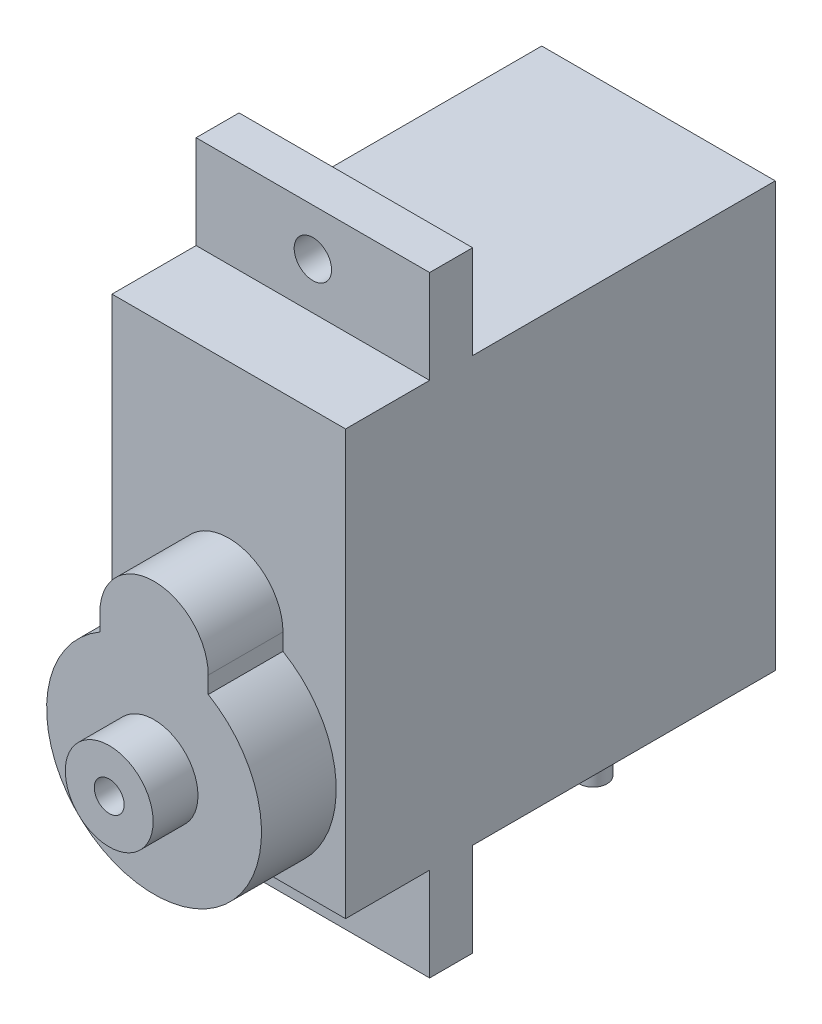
from build123d import *

# Parameters (mm, degrees)
CROQUIS1_W              = 12.5
CROQUIS1_H              = 22.7
SALIENTE_EXTRUIR1_DEPTH = 23
SALIENTE_EXTRUIR2_DEPTH = 4
CROQUIS3_W              = 2.3
CROQUIS3_H              = 5
SALIENTE_EXTRUIR3_DEPTH = 6.25
CORTAR_EXTRUIR1_REACH   = 27.468
CROQUIS4_R              = 1
SALIENTE_EXTRUIR4_START = -4
CROQUIS5_W              = 4
CROQUIS5_H              = 5
SALIENTE_EXTRUIR4_DEPTH = 1.5
CROQUIS6_R              = 2.35
CROQUIS6_R_2            = 0.8
SALIENTE_EXTRUIR5_DEPTH = 2.4
SKETCH1_W               = 4.514706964
SKETCH1_H               = 2.103718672
CUT_EXTRUDE2_DEPTH      = 5


with BuildPart() as part:
    # Croquis1 → Saliente-Extruir1 (new body)
    with BuildSketch(Plane.XY):
        Rectangle(CROQUIS1_W, CROQUIS1_H)
    extrude(amount=SALIENTE_EXTRUIR1_DEPTH)

    # Croquis2 → Saliente-Extruir2 (add)
    with BuildSketch(Plane.XY.offset(23)):
        with BuildLine():
            Line((2.9, 0.265128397), (2.9, -0.634871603))
            ThreePointArc((2.9, -0.634871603), (0, -11.35), (-2.9, -0.634871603))
            Line((-2.9, -0.634871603), (-2.9, 0.265128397))
            ThreePointArc((-2.9, 0.265128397), (0, 3.165128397), (2.9, 0.265128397))
        make_face()
    extrude(amount=SALIENTE_EXTRUIR2_DEPTH)

    # Croquis3 → Saliente-Extruir3 (add, symmetric)
    with BuildSketch(Plane(origin=(0, 0, 0), x_dir=(0, 0, -1), z_dir=(1, 0, 0))):
        with Locations((-17.35, 13.85)):
            Rectangle(CROQUIS3_W, CROQUIS3_H)
        with Locations((-17.35, -13.85)):
            Rectangle(CROQUIS3_W, CROQUIS3_H)
    extrude(amount=SALIENTE_EXTRUIR3_DEPTH, both=True)

    # Croquis4 → Cortar-Extruir1 (cut, up to next)
    with BuildSketch(Plane.XY.offset(18.5), mode=Mode.PRIVATE) as cortar_extruir1_sk1:
        with Locations((0, 13.85)):
            Circle(CROQUIS4_R)
    cortar_extruir1_tool1 = extrude(cortar_extruir1_sk1.sketch, amount=-CORTAR_EXTRUIR1_REACH, mode=Mode.PRIVATE) & part.part
    # Croquis4 → Cortar-Extruir1 (cut, up to next)
    with BuildSketch(Plane.XY.offset(18.5), mode=Mode.PRIVATE) as cortar_extruir1_sk2:
        with Locations(Location((0, -13.85, 0), (0, 0, 270))):
            Circle(CROQUIS4_R)
    cortar_extruir1_tool2 = extrude(cortar_extruir1_sk2.sketch, amount=-CORTAR_EXTRUIR1_REACH, mode=Mode.PRIVATE) & part.part
    add(cortar_extruir1_tool1.solids().sort_by_distance((0, 13.85, 18.5))[0], mode=Mode.SUBTRACT)
    add(cortar_extruir1_tool2.solids().sort_by_distance((0, -13.85, 18.5))[0], mode=Mode.SUBTRACT)

    # Croquis5 → Saliente-Extruir4 (add)
    with BuildSketch(Plane(origin=(0, 0, 0), x_dir=(-1, 0, 0), z_dir=(0, 0, -1)).offset(SALIENTE_EXTRUIR4_START)):
        with Locations((0, -13.85)):
            Rectangle(CROQUIS5_W, CROQUIS5_H)
    extrude(amount=-SALIENTE_EXTRUIR4_DEPTH)

    # Croquis6 → Saliente-Extruir5 (add)
    with BuildSketch(Plane.XY.offset(27)):
        with Locations((0, -5.6)):
            Circle(CROQUIS6_R)
        with Locations((0, -5.6)):
            Circle(CROQUIS6_R_2, mode=Mode.SUBTRACT)
    extrude(amount=SALIENTE_EXTRUIR5_DEPTH)

    # Sketch1 → Cut-Extrude2 (cut)
    with BuildSketch(Plane.XZ.offset(16.35)):
        with Locations((0, 4.75)):
            Rectangle(SKETCH1_W, SKETCH1_H)
        with BuildLine():
            ThreePointArc((-0.625, 4.335421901), (-2, 4.75), (-0.625, 5.164578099))
            ThreePointArc((-0.625, 5.164578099), (0, 5.5), (0.625, 5.164578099))
            ThreePointArc((0.625, 5.164578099), (2, 4.75), (0.625, 4.335421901))
            ThreePointArc((0.625, 4.335421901), (0, 4), (-0.625, 4.335421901))
        make_face(mode=Mode.SUBTRACT)
    extrude(amount=-CUT_EXTRUDE2_DEPTH, mode=Mode.SUBTRACT)


solid = part.part
